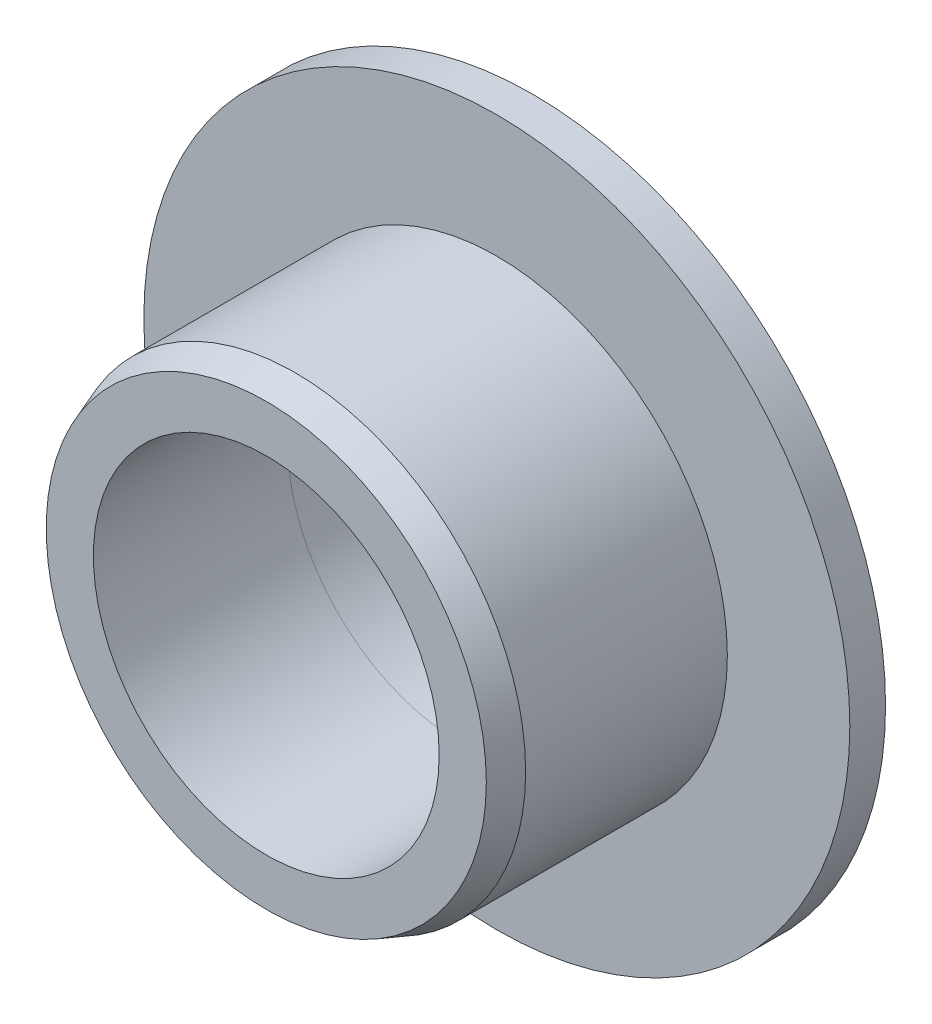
from build123d import *

# Parameters (mm, degrees)
ESQUISSE1_R             = 24.5
BASE_EXTRUSION_DEPTH    = 2.48
ESQUISSE2_R             = 16
BOSS_EXTRU_1_DEPTH      = 16
CHANFREIN1_SIZE         = 2
CHANFREIN1_SIZE2        = 0.727940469
ESQUISSE3_R             = 12
ENL_V_MAT_EXTRU_1_DEPTH = 40.268440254
CHANFREIN2_SIZE         = 0.5
ESQUISSE4_R             = 12.05
ENL_V_MAT_EXTRU_2_DEPTH = 5


with BuildPart() as part:
    # Esquisse1 → Base-Extrusion (new body)
    with BuildSketch(Plane.XY):
        Circle(ESQUISSE1_R)
    extrude(amount=BASE_EXTRUSION_DEPTH)

    # Esquisse2 → Boss.-Extru.1 (add)
    with BuildSketch(Plane.XY.offset(2.48)):
        Circle(ESQUISSE2_R)
    extrude(amount=BOSS_EXTRU_1_DEPTH)

    # Chanfrein1
    chanfrein1_edges = [part.edges().sort_by_distance(p)[0] for p in [
        (-16, 0, 18.48),
    ]]
    chanfrein1_side = [part.faces().sort_by_distance(p)[0] for p in [
        (-16, 0, 10.48),
    ]]
    chamfer(chanfrein1_edges, length=CHANFREIN1_SIZE, length2=CHANFREIN1_SIZE2, reference=chanfrein1_side[0])

    # Esquisse3 → Enl_v. mat.-Extru.1 (cut, through all)
    with BuildSketch(Plane.XY.offset(18.48)):
        Circle(ESQUISSE3_R)
    extrude(amount=-ENL_V_MAT_EXTRU_1_DEPTH, mode=Mode.SUBTRACT)

    # Chanfrein2
    chanfrein2_edges = [part.edges().sort_by_distance(p)[0] for p in [
        (-12, 0, 0),
    ]]
    chamfer(chanfrein2_edges, length=CHANFREIN2_SIZE)

    # Esquisse4 → Enl_v. mat.-Extru.2 (cut)
    with BuildSketch(Plane(origin=(0, 0, 0), x_dir=(-1, 0, 0), z_dir=(0, 0, -1))):
        Circle(ESQUISSE4_R)
    extrude(amount=-ENL_V_MAT_EXTRU_2_DEPTH, mode=Mode.SUBTRACT)


solid = part.part
